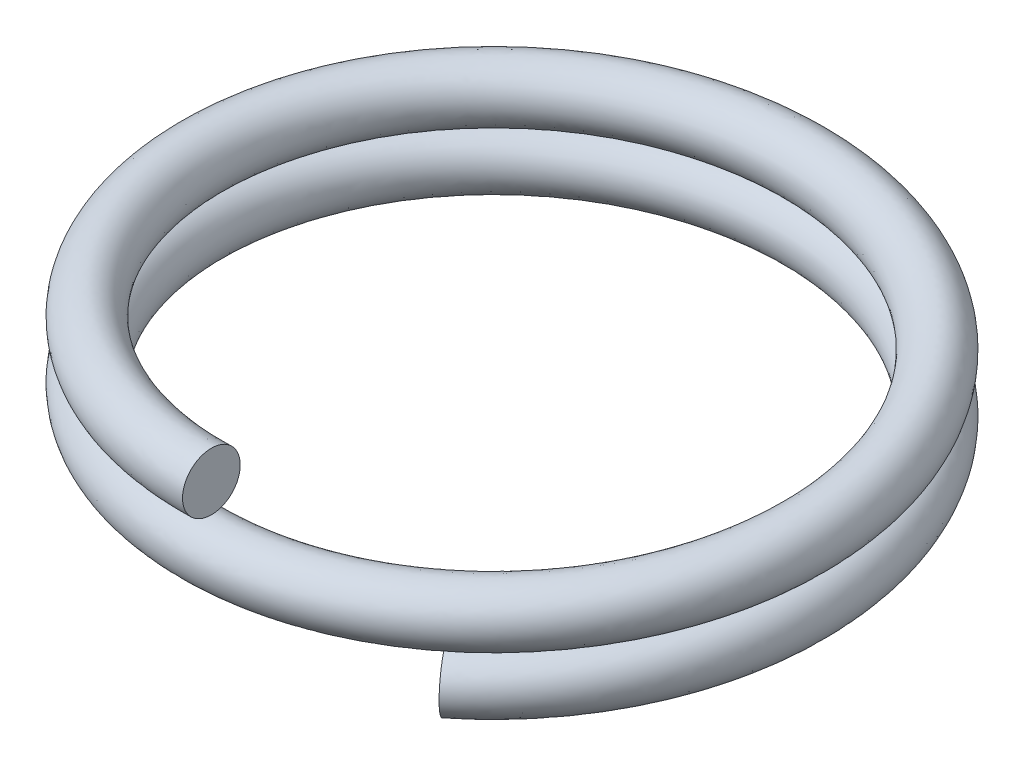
from build123d import *

# Parameters (mm, degrees)
SWEEP2_PITCH       = 2.794279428
SWEEP2_HEIGHT      = 5.309130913
SWEEP2_RADIUS      = 14.5415
SWEEP2_START_ANGLE = -180
SKETCH5_R          = 1.397


with BuildPart() as part:
    # Sweep2: sweep along a helix
    with BuildLine() as sweep2_path:
        add(Helix(SWEEP2_PITCH, SWEEP2_HEIGHT, SWEEP2_RADIUS, center=(0, 0, 0), direction=(0, -1, 0), mode=Mode.PRIVATE).rotate(Axis((0, 0, 0), (0, -1, 0)), SWEEP2_START_ANGLE))
    # Sketch5 → Sweep2 (sweep)
    with BuildSketch(Plane(origin=(0, 0, 0), x_dir=(0, 0, -1), z_dir=(1, 0, 0))):
        with Locations((-14.5415, 0)):
            Circle(SKETCH5_R)
    sweep(path=sweep2_path.line, is_frenet=True)


solid = part.part
